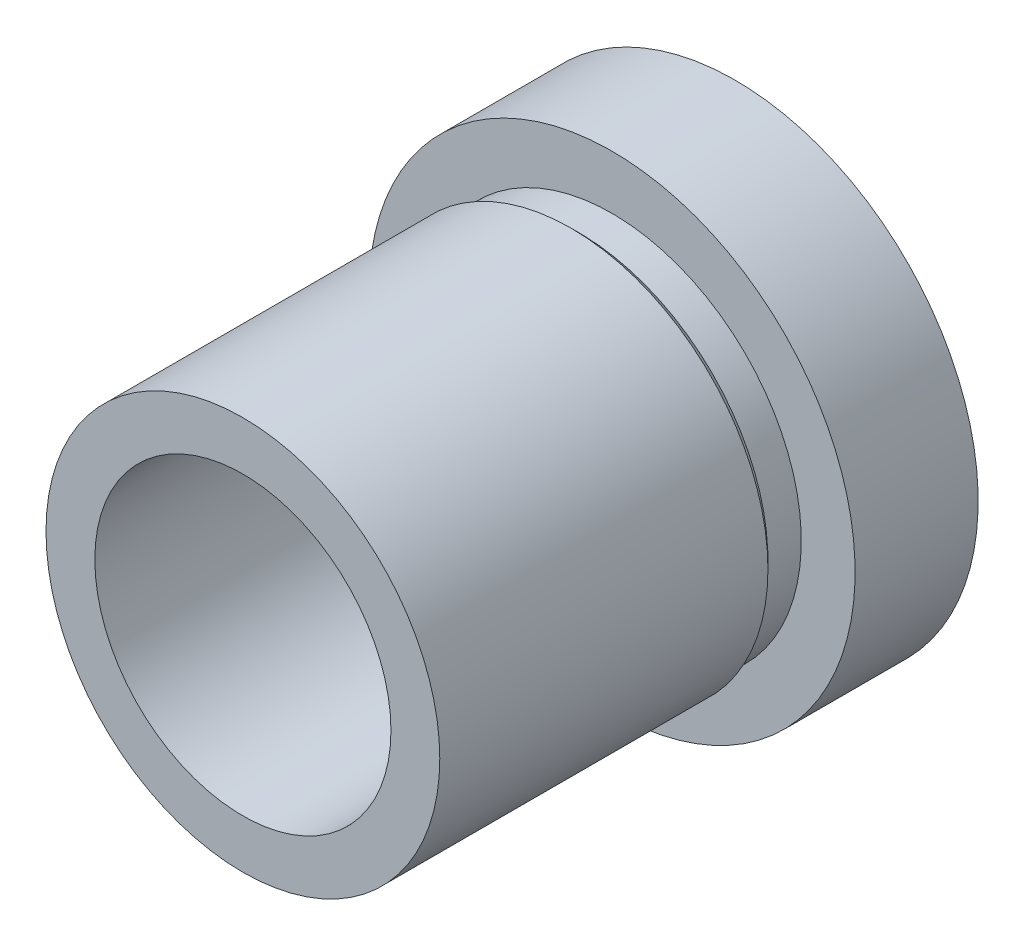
ISO-10303-21;
HEADER;
FILE_DESCRIPTION(('STEP AP214'),'2;1');
FILE_NAME('part.step','',(''),(''),'','','');
FILE_SCHEMA(('AUTOMOTIVE_DESIGN { 1 0 10303 214 1 1 1 1 }'));
ENDSEC;
DATA;
#1=APPLICATION_CONTEXT('core data for automotive mechanical design processes');
#2=APPLICATION_PROTOCOL_DEFINITION('international standard','automotive_design',2000,#1);
#3=PRODUCT_CONTEXT('',#1,'mechanical');
#4=PRODUCT('Part','Part','',(#3));
#5=PRODUCT_RELATED_PRODUCT_CATEGORY('part','',(#4));
#6=PRODUCT_DEFINITION_FORMATION('','',#4);
#7=PRODUCT_DEFINITION_CONTEXT('part definition',#1,'design');
#8=PRODUCT_DEFINITION('design','',#6,#7);
#9=PRODUCT_DEFINITION_SHAPE('','',#8);
#10=(LENGTH_UNIT() NAMED_UNIT(*) SI_UNIT(.MILLI.,.METRE.));
#11=(NAMED_UNIT(*) PLANE_ANGLE_UNIT() SI_UNIT($,.RADIAN.));
#12=(NAMED_UNIT(*) SI_UNIT($,.STERADIAN.) SOLID_ANGLE_UNIT());
#13=UNCERTAINTY_MEASURE_WITH_UNIT(LENGTH_MEASURE(1.E-05),#10,'distance_accuracy_value','');
#14=(GEOMETRIC_REPRESENTATION_CONTEXT(3) GLOBAL_UNCERTAINTY_ASSIGNED_CONTEXT((#13)) GLOBAL_UNIT_ASSIGNED_CONTEXT((#10,
#11,#12)) REPRESENTATION_CONTEXT('',''));
#15=CARTESIAN_POINT('',(0.,0.,0.));
#16=DIRECTION('',(0.,0.,1.));
#17=DIRECTION('',(1.,0.,0.));
#18=AXIS2_PLACEMENT_3D('',#15,#16,#17);
#19=CARTESIAN_POINT('',(-15.6765625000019,9.88098491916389E-12,-7.9375));
#20=DIRECTION('',(0.,0.,1.));
#21=DIRECTION('',(1.00000000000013,0.,0.));
#22=AXIS2_PLACEMENT_3D('',#19,#20,#21);
#23=PLANE('',#22);
#24=CARTESIAN_POINT('',(0.,0.,-7.9375));
#25=DIRECTION('',(0.,0.,-1.));
#26=DIRECTION('',(-1.00000000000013,0.,0.));
#27=AXIS2_PLACEMENT_3D('',#24,#25,#26);
#28=CIRCLE('',#27,15.6765625);
#29=CARTESIAN_POINT('',(-15.676562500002,0.,-7.9375));
#30=VERTEX_POINT('',#29);
#31=EDGE_CURVE('E81',#30,#30,#28,.T.);
#32=ORIENTED_EDGE('',*,*,#31,.T.);
#33=EDGE_LOOP('',(#32));
#34=FACE_BOUND('',#33,.T.);
#35=CARTESIAN_POINT('',(0.,0.,-7.9375));
#36=DIRECTION('',(0.,0.,1.));
#37=DIRECTION('',(1.00000000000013,0.,0.));
#38=AXIS2_PLACEMENT_3D('',#35,#36,#37);
#39=CIRCLE('',#38,9.5503999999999);
#40=CARTESIAN_POINT('',(9.55040000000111,0.,-7.9375));
#41=VERTEX_POINT('',#40);
#42=EDGE_CURVE('E10',#41,#41,#39,.T.);
#43=ORIENTED_EDGE('',*,*,#42,.T.);
#44=EDGE_LOOP('',(#43));
#45=FACE_BOUND('',#44,.T.);
#46=ADVANCED_FACE('F43',(#34,#45),#23,.F.);
#47=CARTESIAN_POINT('',(0.,0.,-19.4322936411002));
#48=DIRECTION('',(0.,0.,-1.));
#49=DIRECTION('',(-1.00000000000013,0.,0.));
#50=AXIS2_PLACEMENT_3D('',#47,#48,#49);
#51=CYLINDRICAL_SURFACE('',#50,9.5503999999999);
#52=CARTESIAN_POINT('',(0.,0.,23.8125));
#53=DIRECTION('',(0.,0.,-1.));
#54=DIRECTION('',(-1.00000000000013,0.,0.));
#55=AXIS2_PLACEMENT_3D('',#52,#53,#54);
#56=CIRCLE('',#55,9.5503999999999);
#57=CARTESIAN_POINT('',(-9.55040000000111,0.,23.8125));
#58=VERTEX_POINT('',#57);
#59=EDGE_CURVE('E51',#58,#58,#56,.T.);
#60=ORIENTED_EDGE('',*,*,#59,.F.);
#61=EDGE_LOOP('',(#60));
#62=FACE_BOUND('',#61,.T.);
#63=ORIENTED_EDGE('',*,*,#42,.F.);
#64=EDGE_LOOP('',(#63));
#65=FACE_BOUND('',#64,.T.);
#66=ADVANCED_FACE('F45',(#62,#65),#51,.F.);
#67=CARTESIAN_POINT('',(-9.55040000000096,4.44089209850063E-12,23.8125));
#68=DIRECTION('',(0.,0.,-1.));
#69=DIRECTION('',(-1.00000000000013,0.,0.));
#70=AXIS2_PLACEMENT_3D('',#67,#68,#69);
#71=PLANE('',#70);
#72=CARTESIAN_POINT('',(0.,0.,23.8125));
#73=DIRECTION('',(0.,0.,-1.));
#74=DIRECTION('',(-1.00000000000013,0.,0.));
#75=AXIS2_PLACEMENT_3D('',#72,#73,#74);
#76=CIRCLE('',#75,12.7);
#77=CARTESIAN_POINT('',(-12.7000000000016,0.,23.8125));
#78=VERTEX_POINT('',#77);
#79=EDGE_CURVE('E57',#78,#78,#76,.T.);
#80=ORIENTED_EDGE('',*,*,#79,.F.);
#81=EDGE_LOOP('',(#80));
#82=FACE_BOUND('',#81,.T.);
#83=ORIENTED_EDGE('',*,*,#59,.T.);
#84=EDGE_LOOP('',(#83));
#85=FACE_BOUND('',#84,.T.);
#86=ADVANCED_FACE('F115',(#82,#85),#71,.F.);
#87=CARTESIAN_POINT('',(0.,0.,-19.4322936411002));
#88=DIRECTION('',(0.,0.,-1.));
#89=DIRECTION('',(-1.00000000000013,0.,0.));
#90=AXIS2_PLACEMENT_3D('',#87,#88,#89);
#91=CYLINDRICAL_SURFACE('',#90,12.7);
#92=CARTESIAN_POINT('',(0.,0.,2.64583333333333));
#93=DIRECTION('',(0.,0.,-1.));
#94=DIRECTION('',(-1.00000000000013,0.,0.));
#95=AXIS2_PLACEMENT_3D('',#92,#93,#94);
#96=CIRCLE('',#95,12.7);
#97=CARTESIAN_POINT('',(-12.7000000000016,0.,2.64583333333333));
#98=VERTEX_POINT('',#97);
#99=EDGE_CURVE('E63',#98,#98,#96,.T.);
#100=ORIENTED_EDGE('',*,*,#99,.F.);
#101=EDGE_LOOP('',(#100));
#102=FACE_BOUND('',#101,.T.);
#103=ORIENTED_EDGE('',*,*,#79,.T.);
#104=EDGE_LOOP('',(#103));
#105=FACE_BOUND('',#104,.T.);
#106=ADVANCED_FACE('F109',(#102,#105),#91,.T.);
#107=CARTESIAN_POINT('',(0.,0.,2.64583333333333));
#108=DIRECTION('',(0.,0.,1.));
#109=DIRECTION('',(1.00000000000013,0.,0.));
#110=AXIS2_PLACEMENT_3D('',#107,#108,#109);
#111=CONICAL_SURFACE('',#110,12.7,0.785398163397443);
#112=CARTESIAN_POINT('',(0.,0.,2.14973958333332));
#113=DIRECTION('',(0.,0.,-1.));
#114=DIRECTION('',(-1.00000000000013,0.,0.));
#115=AXIS2_PLACEMENT_3D('',#112,#113,#114);
#116=CIRCLE('',#115,12.20390625);
#117=CARTESIAN_POINT('',(-12.2039062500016,0.,2.14973958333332));
#118=VERTEX_POINT('',#117);
#119=EDGE_CURVE('E69',#118,#118,#116,.T.);
#120=ORIENTED_EDGE('',*,*,#119,.F.);
#121=EDGE_LOOP('',(#120));
#122=FACE_BOUND('',#121,.T.);
#123=ORIENTED_EDGE('',*,*,#99,.T.);
#124=EDGE_LOOP('',(#123));
#125=FACE_BOUND('',#124,.T.);
#126=ADVANCED_FACE('F103',(#122,#125),#111,.T.);
#127=CARTESIAN_POINT('',(0.,0.,-19.4322936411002));
#128=DIRECTION('',(0.,0.,-1.));
#129=DIRECTION('',(-1.00000000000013,0.,0.));
#130=AXIS2_PLACEMENT_3D('',#127,#128,#129);
#131=CYLINDRICAL_SURFACE('',#130,12.20390625);
#132=CARTESIAN_POINT('',(0.,0.,0.));
#133=DIRECTION('',(0.,0.,-1.));
#134=DIRECTION('',(-1.00000000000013,0.,0.));
#135=AXIS2_PLACEMENT_3D('',#132,#133,#134);
#136=CIRCLE('',#135,12.20390625);
#137=CARTESIAN_POINT('',(-12.2039062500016,0.,0.));
#138=VERTEX_POINT('',#137);
#139=EDGE_CURVE('E73',#138,#138,#136,.T.);
#140=ORIENTED_EDGE('',*,*,#139,.F.);
#141=EDGE_LOOP('',(#140));
#142=FACE_BOUND('',#141,.T.);
#143=ORIENTED_EDGE('',*,*,#119,.T.);
#144=EDGE_LOOP('',(#143));
#145=FACE_BOUND('',#144,.T.);
#146=ADVANCED_FACE('F97',(#142,#145),#131,.T.);
#147=CARTESIAN_POINT('',(-12.2039062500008,5.88418203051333E-12,0.));
#148=DIRECTION('',(0.,0.,-1.));
#149=DIRECTION('',(-1.00000000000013,0.,0.));
#150=AXIS2_PLACEMENT_3D('',#147,#148,#149);
#151=PLANE('',#150);
#152=CARTESIAN_POINT('',(0.,0.,0.));
#153=DIRECTION('',(0.,0.,-1.));
#154=DIRECTION('',(-1.00000000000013,0.,0.));
#155=AXIS2_PLACEMENT_3D('',#152,#153,#154);
#156=CIRCLE('',#155,15.6765625);
#157=CARTESIAN_POINT('',(-15.676562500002,0.,0.));
#158=VERTEX_POINT('',#157);
#159=EDGE_CURVE('E77',#158,#158,#156,.T.);
#160=ORIENTED_EDGE('',*,*,#159,.F.);
#161=EDGE_LOOP('',(#160));
#162=FACE_BOUND('',#161,.T.);
#163=ORIENTED_EDGE('',*,*,#139,.T.);
#164=EDGE_LOOP('',(#163));
#165=FACE_BOUND('',#164,.T.);
#166=ADVANCED_FACE('F91',(#162,#165),#151,.F.);
#167=CARTESIAN_POINT('',(0.,0.,-19.4322936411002));
#168=DIRECTION('',(0.,0.,-1.));
#169=DIRECTION('',(-1.00000000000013,0.,0.));
#170=AXIS2_PLACEMENT_3D('',#167,#168,#169);
#171=CYLINDRICAL_SURFACE('',#170,15.6765625);
#172=ORIENTED_EDGE('',*,*,#31,.F.);
#173=EDGE_LOOP('',(#172));
#174=FACE_BOUND('',#173,.T.);
#175=ORIENTED_EDGE('',*,*,#159,.T.);
#176=EDGE_LOOP('',(#175));
#177=FACE_BOUND('',#176,.T.);
#178=ADVANCED_FACE('F88',(#174,#177),#171,.T.);
#179=CLOSED_SHELL('',(#46,#66,#86,#106,#126,#146,#166,#178));
#180=MANIFOLD_SOLID_BREP('B2',#179);
#181=ADVANCED_BREP_SHAPE_REPRESENTATION('',(#18,#180),#14);
#182=SHAPE_DEFINITION_REPRESENTATION(#9,#181);
ENDSEC;
END-ISO-10303-21;
